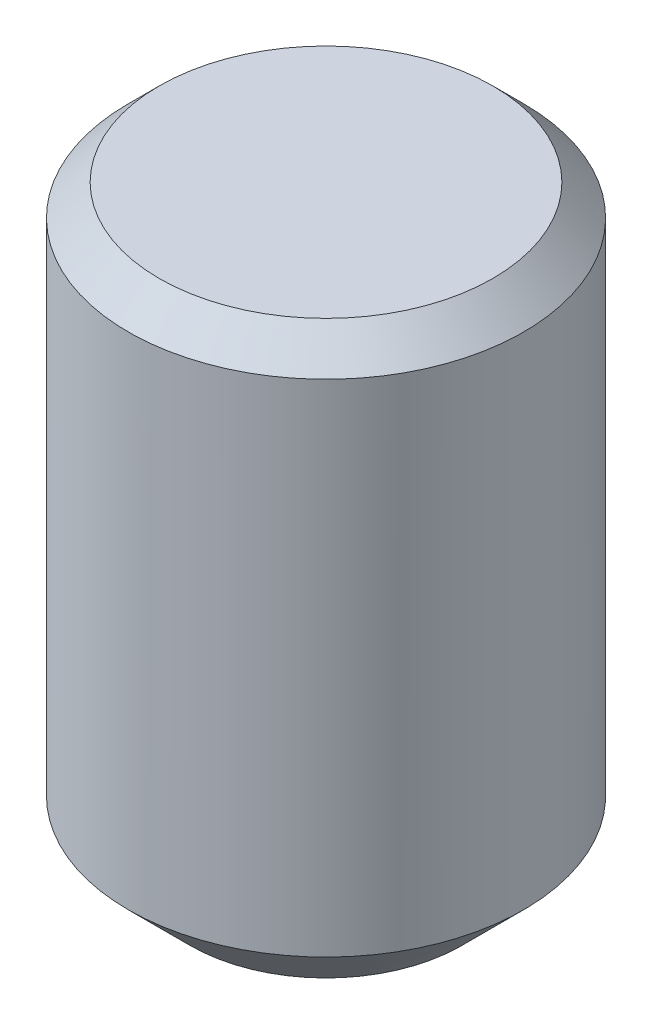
ISO-10303-21;
HEADER;
FILE_DESCRIPTION(('STEP AP214'),'2;1');
FILE_NAME('part.step','',(''),(''),'','','');
FILE_SCHEMA(('AUTOMOTIVE_DESIGN { 1 0 10303 214 1 1 1 1 }'));
ENDSEC;
DATA;
#1=APPLICATION_CONTEXT('core data for automotive mechanical design processes');
#2=APPLICATION_PROTOCOL_DEFINITION('international standard','automotive_design',2000,#1);
#3=PRODUCT_CONTEXT('',#1,'mechanical');
#4=PRODUCT('Part','Part','',(#3));
#5=PRODUCT_RELATED_PRODUCT_CATEGORY('part','',(#4));
#6=PRODUCT_DEFINITION_FORMATION('','',#4);
#7=PRODUCT_DEFINITION_CONTEXT('part definition',#1,'design');
#8=PRODUCT_DEFINITION('design','',#6,#7);
#9=PRODUCT_DEFINITION_SHAPE('','',#8);
#10=(LENGTH_UNIT() NAMED_UNIT(*) SI_UNIT(.MILLI.,.METRE.));
#11=(NAMED_UNIT(*) PLANE_ANGLE_UNIT() SI_UNIT($,.RADIAN.));
#12=(NAMED_UNIT(*) SI_UNIT($,.STERADIAN.) SOLID_ANGLE_UNIT());
#13=UNCERTAINTY_MEASURE_WITH_UNIT(LENGTH_MEASURE(1.E-05),#10,'distance_accuracy_value','');
#14=(GEOMETRIC_REPRESENTATION_CONTEXT(3) GLOBAL_UNCERTAINTY_ASSIGNED_CONTEXT((#13)) GLOBAL_UNIT_ASSIGNED_CONTEXT((#10,
#11,#12)) REPRESENTATION_CONTEXT('',''));
#15=CARTESIAN_POINT('',(0.,0.,0.));
#16=DIRECTION('',(0.,0.,1.));
#17=DIRECTION('',(1.,0.,0.));
#18=AXIS2_PLACEMENT_3D('',#15,#16,#17);
#19=CARTESIAN_POINT('',(2.004519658,-47.,-77.653833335));
#20=DIRECTION('',(0.,-1.,0.));
#21=DIRECTION('',(-1.,0.,0.));
#22=AXIS2_PLACEMENT_3D('',#19,#20,#21);
#23=PLANE('',#22);
#24=DIRECTION('',(-0.866025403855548,0.,0.499999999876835));
#25=VECTOR('',#24,1.);
#26=CARTESIAN_POINT('',(1.004519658,-47.,-78.231183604));
#27=LINE('',#26,#25);
#28=CARTESIAN_POINT('',(2.004519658,-47.,-78.80853387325));
#29=VERTEX_POINT('',#28);
#30=CARTESIAN_POINT('',(0.00451965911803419,-47.,-77.6538333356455));
#31=VERTEX_POINT('',#30);
#32=EDGE_CURVE('E99',#29,#31,#27,.T.);
#33=ORIENTED_EDGE('',*,*,#32,.T.);
#34=DIRECTION('',(-0.866025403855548,0.,-0.499999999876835));
#35=VECTOR('',#34,1.);
#36=CARTESIAN_POINT('',(-0.995480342,-47.,-78.231183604));
#37=LINE('',#36,#35);
#38=CARTESIAN_POINT('',(-1.995480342,-47.,-78.80853387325));
#39=VERTEX_POINT('',#38);
#40=EDGE_CURVE('E80',#31,#39,#37,.T.);
#41=ORIENTED_EDGE('',*,*,#40,.T.);
#42=DIRECTION('',(0.,0.,-1.));
#43=VECTOR('',#42,1.);
#44=CARTESIAN_POINT('',(-1.995480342,-47.,-79.9632344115));
#45=LINE('',#44,#43);
#46=CARTESIAN_POINT('',(-1.995480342,-47.,-81.117934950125));
#47=VERTEX_POINT('',#46);
#48=EDGE_CURVE('E76',#39,#47,#45,.T.);
#49=ORIENTED_EDGE('',*,*,#48,.T.);
#50=DIRECTION('',(0.866025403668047,0.,-0.500000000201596));
#51=VECTOR('',#50,1.);
#52=CARTESIAN_POINT('',(-0.995480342,-47.,-81.6952852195));
#53=LINE('',#52,#51);
#54=CARTESIAN_POINT('',(0.00451965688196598,-47.,-82.2726354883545));
#55=VERTEX_POINT('',#54);
#56=EDGE_CURVE('E78',#47,#55,#53,.T.);
#57=ORIENTED_EDGE('',*,*,#56,.T.);
#58=DIRECTION('',(0.866025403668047,0.,0.500000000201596));
#59=VECTOR('',#58,1.);
#60=CARTESIAN_POINT('',(1.004519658,-47.,-81.6952852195));
#61=LINE('',#60,#59);
#62=CARTESIAN_POINT('',(2.004519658,-47.,-81.11793495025));
#63=VERTEX_POINT('',#62);
#64=EDGE_CURVE('E93',#55,#63,#61,.T.);
#65=ORIENTED_EDGE('',*,*,#64,.T.);
#66=DIRECTION('',(0.,0.,1.));
#67=VECTOR('',#66,1.);
#68=CARTESIAN_POINT('',(2.004519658,-47.,-79.9632344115));
#69=LINE('',#68,#67);
#70=EDGE_CURVE('E96',#63,#29,#69,.T.);
#71=ORIENTED_EDGE('',*,*,#70,.T.);
#72=EDGE_LOOP('',(#33,#41,#49,#57,#65,#71));
#73=FACE_BOUND('',#72,.T.);
#74=ADVANCED_FACE('F16',(#73),#23,.T.);
#75=CARTESIAN_POINT('',(-1.995480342,-47.,-78.808533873));
#76=DIRECTION('',(-1.,0.,0.));
#77=DIRECTION('',(0.,0.,-1.));
#78=AXIS2_PLACEMENT_3D('',#75,#76,#77);
#79=PLANE('',#78);
#80=DIRECTION('',(0.,1.,0.));
#81=VECTOR('',#80,1.);
#82=CARTESIAN_POINT('',(-1.995480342,-48.5,-81.11793495));
#83=LINE('',#82,#81);
#84=CARTESIAN_POINT('',(-1.995480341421,-50.,-81.117934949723));
#85=VERTEX_POINT('',#84);
#86=EDGE_CURVE('E82',#85,#47,#83,.T.);
#87=ORIENTED_EDGE('',*,*,#86,.T.);
#88=ORIENTED_EDGE('',*,*,#48,.F.);
#89=DIRECTION('',(0.,-1.,0.));
#90=VECTOR('',#89,1.);
#91=CARTESIAN_POINT('',(-1.995480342,-48.5,-78.808533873));
#92=LINE('',#91,#90);
#93=CARTESIAN_POINT('',(-1.99548034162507,-50.,-78.8085338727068));
#94=VERTEX_POINT('',#93);
#95=EDGE_CURVE('E50',#39,#94,#92,.T.);
#96=ORIENTED_EDGE('',*,*,#95,.T.);
#97=DIRECTION('',(0.,0.,1.));
#98=VECTOR('',#97,1.);
#99=CARTESIAN_POINT('',(-1.995480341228,-50.,-79.96));
#100=LINE('',#99,#98);
#101=EDGE_CURVE('E56',#85,#94,#100,.T.);
#102=ORIENTED_EDGE('',*,*,#101,.F.);
#103=EDGE_LOOP('',(#87,#88,#96,#102));
#104=FACE_BOUND('',#103,.T.);
#105=ADVANCED_FACE('F83',(#104),#79,.F.);
#106=CARTESIAN_POINT('',(0.004519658,-47.,-77.653833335));
#107=DIRECTION('',(-0.499999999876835,0.,0.866025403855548));
#108=DIRECTION('',(-0.866025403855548,0.,-0.499999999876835));
#109=AXIS2_PLACEMENT_3D('',#106,#107,#108);
#110=PLANE('',#109);
#111=ORIENTED_EDGE('',*,*,#95,.F.);
#112=ORIENTED_EDGE('',*,*,#40,.F.);
#113=DIRECTION('',(0.,-1.,0.));
#114=VECTOR('',#113,1.);
#115=CARTESIAN_POINT('',(0.004519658,-48.5,-77.653833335));
#116=LINE('',#115,#114);
#117=CARTESIAN_POINT('',(0.00451965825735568,-50.,-77.6538333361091));
#118=VERTEX_POINT('',#117);
#119=EDGE_CURVE('E98',#31,#118,#116,.T.);
#120=ORIENTED_EDGE('',*,*,#119,.T.);
#121=DIRECTION('',(0.866025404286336,0.,0.499999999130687));
#122=VECTOR('',#121,1.);
#123=CARTESIAN_POINT('',(-1.995480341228,-50.,-78.808533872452));
#124=LINE('',#123,#122);
#125=EDGE_CURVE('E20',#94,#118,#124,.T.);
#126=ORIENTED_EDGE('',*,*,#125,.F.);
#127=EDGE_LOOP('',(#111,#112,#120,#126));
#128=FACE_BOUND('',#127,.T.);
#129=ADVANCED_FACE('F128',(#128),#110,.F.);
#130=CARTESIAN_POINT('',(2.004519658,-47.,-78.808533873));
#131=DIRECTION('',(0.499999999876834,0.,0.866025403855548));
#132=DIRECTION('',(-0.866025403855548,0.,0.499999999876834));
#133=AXIS2_PLACEMENT_3D('',#130,#131,#132);
#134=PLANE('',#133);
#135=ORIENTED_EDGE('',*,*,#119,.F.);
#136=ORIENTED_EDGE('',*,*,#32,.F.);
#137=DIRECTION('',(0.,-1.,0.));
#138=VECTOR('',#137,1.);
#139=CARTESIAN_POINT('',(2.004519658,-48.5,-78.808533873));
#140=LINE('',#139,#138);
#141=CARTESIAN_POINT('',(2.004519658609,-50.,-78.808533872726));
#142=VERTEX_POINT('',#141);
#143=EDGE_CURVE('E95',#29,#142,#140,.T.);
#144=ORIENTED_EDGE('',*,*,#143,.T.);
#145=DIRECTION('',(0.866025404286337,0.,-0.499999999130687));
#146=VECTOR('',#145,1.);
#147=CARTESIAN_POINT('',(0.00451965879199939,-50.,-77.653833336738));
#148=LINE('',#147,#146);
#149=EDGE_CURVE('E106',#118,#142,#148,.T.);
#150=ORIENTED_EDGE('',*,*,#149,.F.);
#151=EDGE_LOOP('',(#135,#136,#144,#150));
#152=FACE_BOUND('',#151,.T.);
#153=ADVANCED_FACE('F132',(#152),#134,.F.);
#154=CARTESIAN_POINT('',(2.004519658,-47.,-81.11793495));
#155=DIRECTION('',(1.,0.,0.));
#156=DIRECTION('',(0.,0.,1.));
#157=AXIS2_PLACEMENT_3D('',#154,#155,#156);
#158=PLANE('',#157);
#159=ORIENTED_EDGE('',*,*,#143,.F.);
#160=ORIENTED_EDGE('',*,*,#70,.F.);
#161=DIRECTION('',(0.,-1.,0.));
#162=VECTOR('',#161,1.);
#163=CARTESIAN_POINT('',(2.004519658,-48.5,-81.11793495));
#164=LINE('',#163,#162);
#165=CARTESIAN_POINT('',(2.00451965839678,-50.,-81.117934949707));
#166=VERTEX_POINT('',#165);
#167=EDGE_CURVE('E86',#63,#166,#164,.T.);
#168=ORIENTED_EDGE('',*,*,#167,.T.);
#169=DIRECTION('',(0.,0.,-1.));
#170=VECTOR('',#169,1.);
#171=CARTESIAN_POINT('',(2.004519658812,-50.,-79.96));
#172=LINE('',#171,#170);
#173=EDGE_CURVE('E103',#142,#166,#172,.T.);
#174=ORIENTED_EDGE('',*,*,#173,.F.);
#175=EDGE_LOOP('',(#159,#160,#168,#174));
#176=FACE_BOUND('',#175,.T.);
#177=ADVANCED_FACE('F137',(#176),#158,.F.);
#178=CARTESIAN_POINT('',(0.004519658,-47.,-82.272635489));
#179=DIRECTION('',(0.500000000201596,0.,-0.866025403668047));
#180=DIRECTION('',(0.866025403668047,0.,0.500000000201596));
#181=AXIS2_PLACEMENT_3D('',#178,#179,#180);
#182=PLANE('',#181);
#183=ORIENTED_EDGE('',*,*,#167,.F.);
#184=ORIENTED_EDGE('',*,*,#64,.F.);
#185=DIRECTION('',(0.,-1.,0.));
#186=VECTOR('',#185,1.);
#187=CARTESIAN_POINT('',(0.004519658,-48.5,-82.272635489));
#188=LINE('',#187,#186);
#189=CARTESIAN_POINT('',(0.00451965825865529,-50.,-82.2726354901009));
#190=VERTEX_POINT('',#189);
#191=EDGE_CURVE('E35',#55,#190,#188,.T.);
#192=ORIENTED_EDGE('',*,*,#191,.T.);
#193=DIRECTION('',(-0.866025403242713,0.,-0.500000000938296));
#194=VECTOR('',#193,1.);
#195=CARTESIAN_POINT('',(2.004519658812,-50.,-81.117934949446));
#196=LINE('',#195,#194);
#197=EDGE_CURVE('E105',#166,#190,#196,.T.);
#198=ORIENTED_EDGE('',*,*,#197,.F.);
#199=EDGE_LOOP('',(#183,#184,#192,#198));
#200=FACE_BOUND('',#199,.T.);
#201=ADVANCED_FACE('F139',(#200),#182,.F.);
#202=CARTESIAN_POINT('',(-1.995480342,-47.,-81.11793495));
#203=DIRECTION('',(-0.500000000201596,0.,-0.866025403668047));
#204=DIRECTION('',(0.866025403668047,0.,-0.500000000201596));
#205=AXIS2_PLACEMENT_3D('',#202,#203,#204);
#206=PLANE('',#205);
#207=ORIENTED_EDGE('',*,*,#191,.F.);
#208=ORIENTED_EDGE('',*,*,#56,.F.);
#209=ORIENTED_EDGE('',*,*,#86,.F.);
#210=DIRECTION('',(-0.866025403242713,0.,0.500000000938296));
#211=VECTOR('',#210,1.);
#212=CARTESIAN_POINT('',(0.00451965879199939,-50.,-82.272635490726));
#213=LINE('',#212,#211);
#214=EDGE_CURVE('E118',#190,#85,#213,.T.);
#215=ORIENTED_EDGE('',*,*,#214,.F.);
#216=EDGE_LOOP('',(#207,#208,#209,#215));
#217=FACE_BOUND('',#216,.T.);
#218=ADVANCED_FACE('F88',(#217),#206,.F.);
#219=CARTESIAN_POINT('',(2.783,-50.,-77.177));
#220=DIRECTION('',(0.,-1.,0.));
#221=DIRECTION('',(-1.,0.,0.));
#222=AXIS2_PLACEMENT_3D('',#219,#220,#221);
#223=PLANE('',#222);
#224=ORIENTED_EDGE('',*,*,#197,.T.);
#225=ORIENTED_EDGE('',*,*,#214,.T.);
#226=ORIENTED_EDGE('',*,*,#101,.T.);
#227=ORIENTED_EDGE('',*,*,#125,.T.);
#228=ORIENTED_EDGE('',*,*,#149,.T.);
#229=ORIENTED_EDGE('',*,*,#173,.T.);
#230=EDGE_LOOP('',(#224,#225,#226,#227,#228,#229));
#231=FACE_BOUND('',#230,.T.);
#232=CARTESIAN_POINT('',(0.,-50.,-79.96));
#233=DIRECTION('',(0.,1.,0.));
#234=DIRECTION('',(0.,0.,1.));
#235=AXIS2_PLACEMENT_3D('',#232,#233,#234);
#236=CIRCLE('',#235,2.74999999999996);
#237=CARTESIAN_POINT('',(0.,-50.,-77.21));
#238=VERTEX_POINT('',#237);
#239=EDGE_CURVE('E115',#238,#238,#236,.F.);
#240=ORIENTED_EDGE('',*,*,#239,.T.);
#241=EDGE_LOOP('',(#240));
#242=FACE_BOUND('',#241,.T.);
#243=ADVANCED_FACE('F125',(#231,#242),#223,.T.);
#244=CARTESIAN_POINT('',(-3.4155,-38.,-76.5445));
#245=DIRECTION('',(0.,1.,0.));
#246=DIRECTION('',(1.,0.,0.));
#247=AXIS2_PLACEMENT_3D('',#244,#245,#246);
#248=PLANE('',#247);
#249=CARTESIAN_POINT('',(0.,-38.,-79.96));
#250=DIRECTION('',(0.,-1.,0.));
#251=DIRECTION('',(0.,0.,-1.));
#252=AXIS2_PLACEMENT_3D('',#249,#250,#251);
#253=CIRCLE('',#252,3.37500000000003);
#254=CARTESIAN_POINT('',(0.,-38.,-83.335));
#255=VERTEX_POINT('',#254);
#256=EDGE_CURVE('E112',#255,#255,#253,.F.);
#257=ORIENTED_EDGE('',*,*,#256,.T.);
#258=EDGE_LOOP('',(#257));
#259=FACE_BOUND('',#258,.T.);
#260=ADVANCED_FACE('F18',(#259),#248,.T.);
#261=CARTESIAN_POINT('',(0.,-50.,-79.96));
#262=DIRECTION('',(0.,1.,0.));
#263=DIRECTION('',(0.,0.,1.));
#264=AXIS2_PLACEMENT_3D('',#261,#262,#263);
#265=CONICAL_SURFACE('',#264,2.75,0.785398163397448);
#266=ORIENTED_EDGE('',*,*,#239,.F.);
#267=EDGE_LOOP('',(#266));
#268=FACE_BOUND('',#267,.T.);
#269=CARTESIAN_POINT('',(0.,-48.75,-79.96));
#270=DIRECTION('',(0.,-1.,0.));
#271=DIRECTION('',(-1.,0.,0.));
#272=AXIS2_PLACEMENT_3D('',#269,#270,#271);
#273=CIRCLE('',#272,4.);
#274=CARTESIAN_POINT('',(-4.,-48.75,-79.96));
#275=VERTEX_POINT('',#274);
#276=EDGE_CURVE('E26',#275,#275,#273,.T.);
#277=ORIENTED_EDGE('',*,*,#276,.T.);
#278=EDGE_LOOP('',(#277));
#279=FACE_BOUND('',#278,.T.);
#280=ADVANCED_FACE('F157',(#268,#279),#265,.T.);
#281=CARTESIAN_POINT('',(0.,-38.,-79.96));
#282=DIRECTION('',(0.,-1.,0.));
#283=DIRECTION('',(0.,0.,-1.));
#284=AXIS2_PLACEMENT_3D('',#281,#282,#283);
#285=CONICAL_SURFACE('',#284,3.375,0.785398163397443);
#286=ORIENTED_EDGE('',*,*,#256,.F.);
#287=EDGE_LOOP('',(#286));
#288=FACE_BOUND('',#287,.T.);
#289=CARTESIAN_POINT('',(0.,-38.625,-79.96));
#290=DIRECTION('',(0.,-1.,0.));
#291=DIRECTION('',(-1.,0.,0.));
#292=AXIS2_PLACEMENT_3D('',#289,#290,#291);
#293=CIRCLE('',#292,4.);
#294=CARTESIAN_POINT('',(-4.,-38.625,-79.96));
#295=VERTEX_POINT('',#294);
#296=EDGE_CURVE('E11',#295,#295,#293,.F.);
#297=ORIENTED_EDGE('',*,*,#296,.T.);
#298=EDGE_LOOP('',(#297));
#299=FACE_BOUND('',#298,.T.);
#300=ADVANCED_FACE('F151',(#288,#299),#285,.T.);
#301=CARTESIAN_POINT('',(0.,-38.625,-79.96));
#302=DIRECTION('',(0.,-1.,0.));
#303=DIRECTION('',(0.,0.,-1.));
#304=AXIS2_PLACEMENT_3D('',#301,#302,#303);
#305=CYLINDRICAL_SURFACE('',#304,4.);
#306=ORIENTED_EDGE('',*,*,#276,.F.);
#307=EDGE_LOOP('',(#306));
#308=FACE_BOUND('',#307,.T.);
#309=ORIENTED_EDGE('',*,*,#296,.F.);
#310=EDGE_LOOP('',(#309));
#311=FACE_BOUND('',#310,.T.);
#312=ADVANCED_FACE('F149',(#308,#311),#305,.T.);
#313=CLOSED_SHELL('',(#74,#105,#129,#153,#177,#201,#218,#243,#260,#280,#300,#312));
#314=MANIFOLD_SOLID_BREP('B1',#313);
#315=ADVANCED_BREP_SHAPE_REPRESENTATION('',(#18,#314),#14);
#316=SHAPE_DEFINITION_REPRESENTATION(#9,#315);
ENDSEC;
END-ISO-10303-21;
